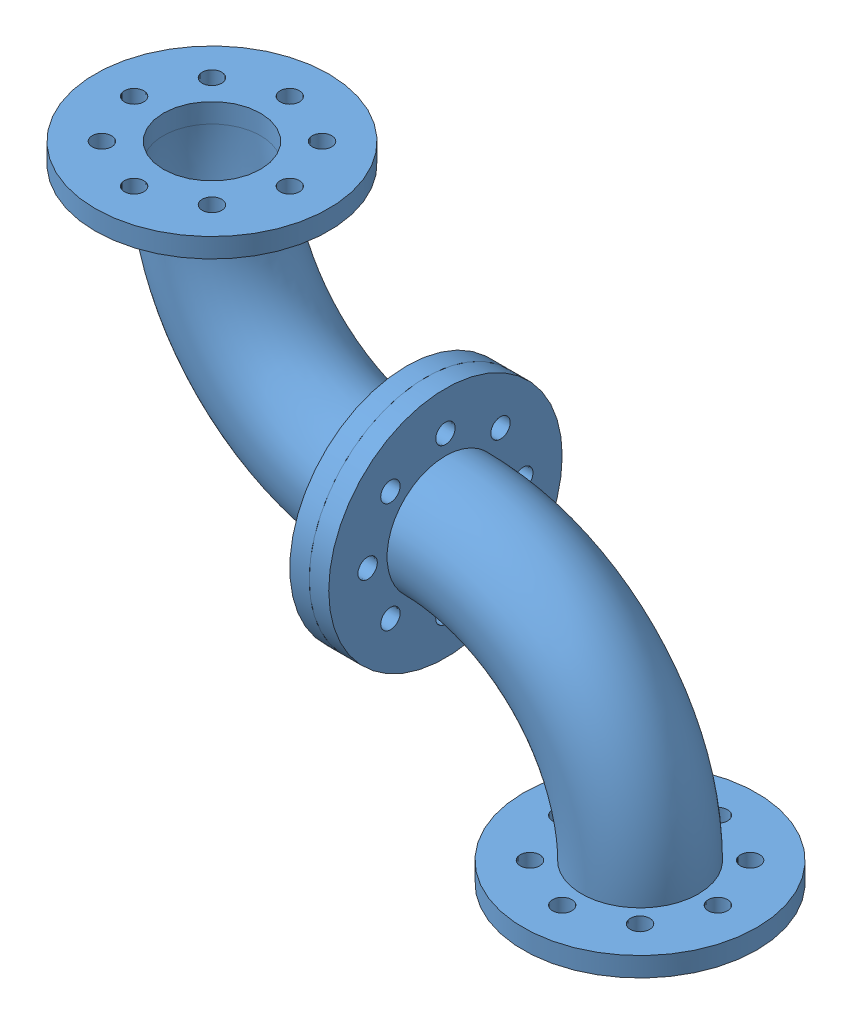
SolidWorks assembly Pattern-Based-Mates.SLDASM, configuration Default (file format 11000). Lengths in mm.
Overall size (170 110 60).
2 component instances, 1 part files, 3 mates.
Components (placement in the parent):
- pipe1-1: pipe1.SLDPRT [Default] at origin size (85 85 60)
- pipe1-2: pipe1.SLDPRT [Default] at (10 -100 0) x (0 -1 0) z (0 0 -1) size (85 85 60)
Mates (geometry in assembly coordinates):
- Concentric11: concentric: cylinder of assembly; cylinder of assembly; cylinder of pipe1-1 through (5 -50 0) axis (-1 0 0) radius 30; cylinder of pipe1-2 through (5 -50 0) axis (1 0 0) radius 30
- Concentric21: concentric: cylinder of assembly; cylinder of assembly; cylinder of pipe1-1 through (5.001 -30 0) axis (-1 0 0) radius 2.5; cylinder of pipe1-2 through (90.001 -30 0) axis (-1 0 0) radius 2.5
- Coincident11: coincident: plane of assembly; plane of assembly; plane of pipe1-1 through (5 -50 0) normal (1 0 0); plane of pipe1-2 through (5 -50 0) normal (-1 0 0)
